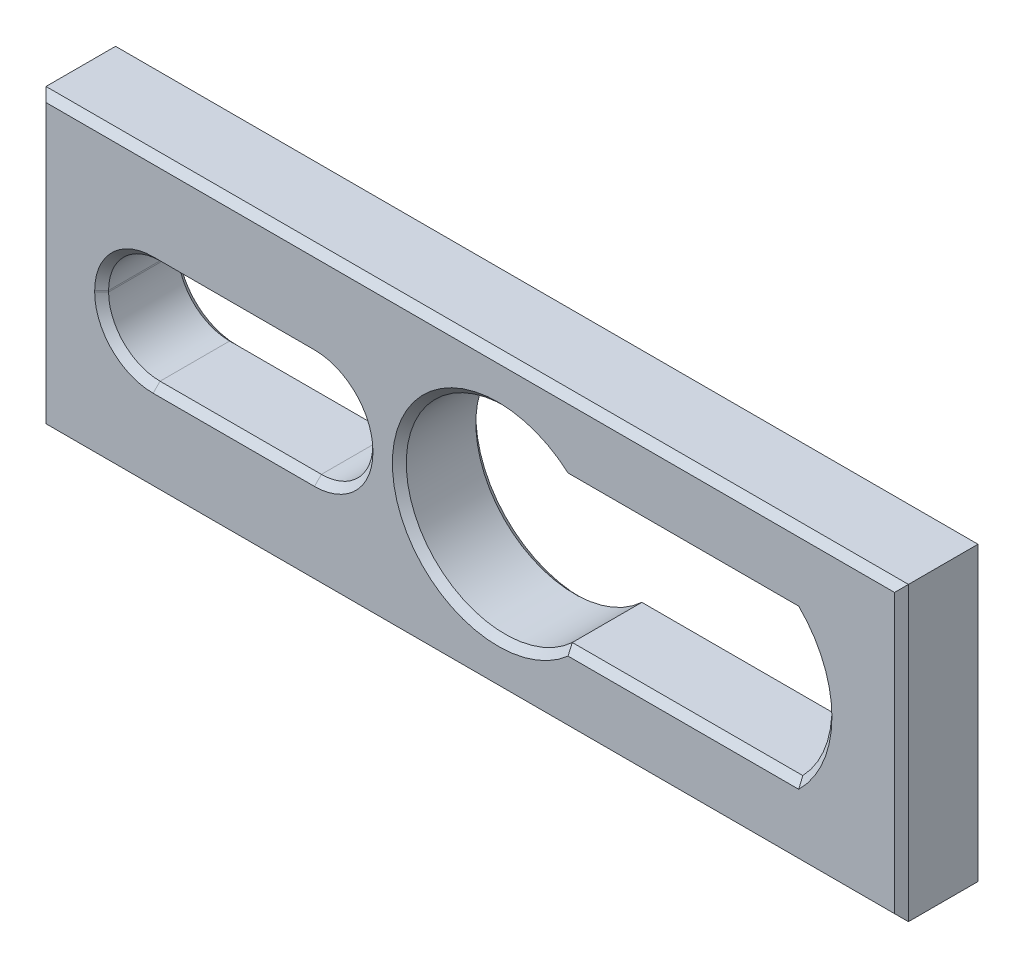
ISO-10303-21;
HEADER;
FILE_DESCRIPTION(('STEP AP214'),'2;1');
FILE_NAME('part.step','',(''),(''),'','','');
FILE_SCHEMA(('AUTOMOTIVE_DESIGN { 1 0 10303 214 1 1 1 1 }'));
ENDSEC;
DATA;
#1=APPLICATION_CONTEXT('core data for automotive mechanical design processes');
#2=APPLICATION_PROTOCOL_DEFINITION('international standard','automotive_design',2000,#1);
#3=PRODUCT_CONTEXT('',#1,'mechanical');
#4=PRODUCT('Part','Part','',(#3));
#5=PRODUCT_RELATED_PRODUCT_CATEGORY('part','',(#4));
#6=PRODUCT_DEFINITION_FORMATION('','',#4);
#7=PRODUCT_DEFINITION_CONTEXT('part definition',#1,'design');
#8=PRODUCT_DEFINITION('design','',#6,#7);
#9=PRODUCT_DEFINITION_SHAPE('','',#8);
#10=(LENGTH_UNIT() NAMED_UNIT(*) SI_UNIT(.MILLI.,.METRE.));
#11=(NAMED_UNIT(*) PLANE_ANGLE_UNIT() SI_UNIT($,.RADIAN.));
#12=(NAMED_UNIT(*) SI_UNIT($,.STERADIAN.) SOLID_ANGLE_UNIT());
#13=UNCERTAINTY_MEASURE_WITH_UNIT(LENGTH_MEASURE(1.E-05),#10,'distance_accuracy_value','');
#14=(GEOMETRIC_REPRESENTATION_CONTEXT(3) GLOBAL_UNCERTAINTY_ASSIGNED_CONTEXT((#13)) GLOBAL_UNIT_ASSIGNED_CONTEXT((#10,
#11,#12)) REPRESENTATION_CONTEXT('',''));
#15=CARTESIAN_POINT('',(0.,0.,0.));
#16=DIRECTION('',(0.,0.,1.));
#17=DIRECTION('',(1.,0.,0.));
#18=AXIS2_PLACEMENT_3D('',#15,#16,#17);
#19=CARTESIAN_POINT('',(31.,10.5,6.));
#20=DIRECTION('',(-1.,0.,0.));
#21=DIRECTION('',(0.,0.,1.));
#22=AXIS2_PLACEMENT_3D('',#19,#20,#21);
#23=PLANE('',#22);
#24=DIRECTION('',(0.,0.,-1.));
#25=VECTOR('',#24,1.);
#26=CARTESIAN_POINT('',(31.,-10.5,6.));
#27=LINE('',#26,#25);
#28=CARTESIAN_POINT('',(31.,-10.5,5.5));
#29=VERTEX_POINT('',#28);
#30=CARTESIAN_POINT('',(31.,-10.5,0.5));
#31=VERTEX_POINT('',#30);
#32=EDGE_CURVE('E557',#29,#31,#27,.T.);
#33=ORIENTED_EDGE('',*,*,#32,.T.);
#34=DIRECTION('',(0.,1.,0.));
#35=VECTOR('',#34,1.);
#36=CARTESIAN_POINT('',(31.,10.5,0.5));
#37=LINE('',#36,#35);
#38=CARTESIAN_POINT('',(31.,10.5,0.5));
#39=VERTEX_POINT('',#38);
#40=EDGE_CURVE('E448',#31,#39,#37,.T.);
#41=ORIENTED_EDGE('',*,*,#40,.T.);
#42=DIRECTION('',(0.,0.,-1.));
#43=VECTOR('',#42,1.);
#44=CARTESIAN_POINT('',(31.,10.5,6.));
#45=LINE('',#44,#43);
#46=CARTESIAN_POINT('',(31.,10.5,5.5));
#47=VERTEX_POINT('',#46);
#48=EDGE_CURVE('E267',#47,#39,#45,.T.);
#49=ORIENTED_EDGE('',*,*,#48,.F.);
#50=DIRECTION('',(0.,-1.,0.));
#51=VECTOR('',#50,1.);
#52=CARTESIAN_POINT('',(31.,-10.5,5.5));
#53=LINE('',#52,#51);
#54=EDGE_CURVE('E446',#47,#29,#53,.T.);
#55=ORIENTED_EDGE('',*,*,#54,.T.);
#56=EDGE_LOOP('',(#33,#41,#49,#55));
#57=FACE_BOUND('',#56,.T.);
#58=ADVANCED_FACE('F32',(#57),#23,.F.);
#59=CARTESIAN_POINT('',(-31.,10.5,6.));
#60=DIRECTION('',(0.,-1.,0.));
#61=DIRECTION('',(0.,0.,-1.));
#62=AXIS2_PLACEMENT_3D('',#59,#60,#61);
#63=PLANE('',#62);
#64=ORIENTED_EDGE('',*,*,#48,.T.);
#65=DIRECTION('',(-1.,0.,0.));
#66=VECTOR('',#65,1.);
#67=CARTESIAN_POINT('',(-31.,10.5,0.5));
#68=LINE('',#67,#66);
#69=CARTESIAN_POINT('',(-31.,10.5,0.5));
#70=VERTEX_POINT('',#69);
#71=EDGE_CURVE('E266',#39,#70,#68,.T.);
#72=ORIENTED_EDGE('',*,*,#71,.T.);
#73=DIRECTION('',(0.,0.,-1.));
#74=VECTOR('',#73,1.);
#75=CARTESIAN_POINT('',(-31.,10.5,6.));
#76=LINE('',#75,#74);
#77=CARTESIAN_POINT('',(-31.,10.5,5.5));
#78=VERTEX_POINT('',#77);
#79=EDGE_CURVE('E249',#78,#70,#76,.T.);
#80=ORIENTED_EDGE('',*,*,#79,.F.);
#81=DIRECTION('',(1.,0.,0.));
#82=VECTOR('',#81,1.);
#83=CARTESIAN_POINT('',(31.,10.5,5.5));
#84=LINE('',#83,#82);
#85=EDGE_CURVE('E263',#78,#47,#84,.T.);
#86=ORIENTED_EDGE('',*,*,#85,.T.);
#87=EDGE_LOOP('',(#64,#72,#80,#86));
#88=FACE_BOUND('',#87,.T.);
#89=ADVANCED_FACE('F262',(#88),#63,.F.);
#90=CARTESIAN_POINT('',(-31.,10.5,6.));
#91=DIRECTION('',(1.,0.,0.));
#92=DIRECTION('',(0.,0.,-1.));
#93=AXIS2_PLACEMENT_3D('',#90,#91,#92);
#94=PLANE('',#93);
#95=ORIENTED_EDGE('',*,*,#79,.T.);
#96=DIRECTION('',(0.,-1.,0.));
#97=VECTOR('',#96,1.);
#98=CARTESIAN_POINT('',(-31.,10.5,0.5));
#99=LINE('',#98,#97);
#100=CARTESIAN_POINT('',(-31.,-10.5,0.5));
#101=VERTEX_POINT('',#100);
#102=EDGE_CURVE('E255',#70,#101,#99,.T.);
#103=ORIENTED_EDGE('',*,*,#102,.T.);
#104=DIRECTION('',(0.,0.,-1.));
#105=VECTOR('',#104,1.);
#106=CARTESIAN_POINT('',(-31.,-10.5,6.));
#107=LINE('',#106,#105);
#108=CARTESIAN_POINT('',(-31.,-10.5,5.5));
#109=VERTEX_POINT('',#108);
#110=EDGE_CURVE('E251',#109,#101,#107,.T.);
#111=ORIENTED_EDGE('',*,*,#110,.F.);
#112=DIRECTION('',(0.,1.,0.));
#113=VECTOR('',#112,1.);
#114=CARTESIAN_POINT('',(-31.,10.5,5.5));
#115=LINE('',#114,#113);
#116=EDGE_CURVE('E246',#109,#78,#115,.T.);
#117=ORIENTED_EDGE('',*,*,#116,.T.);
#118=EDGE_LOOP('',(#95,#103,#111,#117));
#119=FACE_BOUND('',#118,.T.);
#120=ADVANCED_FACE('F248',(#119),#94,.F.);
#121=CARTESIAN_POINT('',(-31.,-10.5,6.));
#122=DIRECTION('',(0.,1.,0.));
#123=DIRECTION('',(-1.,0.,0.));
#124=AXIS2_PLACEMENT_3D('',#121,#122,#123);
#125=PLANE('',#124);
#126=ORIENTED_EDGE('',*,*,#110,.T.);
#127=DIRECTION('',(1.,0.,0.));
#128=VECTOR('',#127,1.);
#129=CARTESIAN_POINT('',(-31.,-10.5,0.5));
#130=LINE('',#129,#128);
#131=EDGE_CURVE('E449',#101,#31,#130,.T.);
#132=ORIENTED_EDGE('',*,*,#131,.T.);
#133=ORIENTED_EDGE('',*,*,#32,.F.);
#134=DIRECTION('',(-1.,0.,0.));
#135=VECTOR('',#134,1.);
#136=CARTESIAN_POINT('',(-31.,-10.5,5.5));
#137=LINE('',#136,#135);
#138=EDGE_CURVE('E435',#29,#109,#137,.T.);
#139=ORIENTED_EDGE('',*,*,#138,.T.);
#140=EDGE_LOOP('',(#126,#132,#133,#139));
#141=FACE_BOUND('',#140,.T.);
#142=ADVANCED_FACE('F622',(#141),#125,.F.);
#143=CARTESIAN_POINT('',(0.,0.,6.));
#144=DIRECTION('',(0.,0.,1.));
#145=DIRECTION('',(1.,0.,0.));
#146=AXIS2_PLACEMENT_3D('',#143,#144,#145);
#147=PLANE('',#146);
#148=DIRECTION('',(0.,-1.,0.));
#149=VECTOR('',#148,1.);
#150=CARTESIAN_POINT('',(-30.5,-10.5,6.));
#151=LINE('',#150,#149);
#152=CARTESIAN_POINT('',(-30.5,10.,6.));
#153=VERTEX_POINT('',#152);
#154=CARTESIAN_POINT('',(-30.5,-10.,6.));
#155=VERTEX_POINT('',#154);
#156=EDGE_CURVE('E45',#153,#155,#151,.T.);
#157=ORIENTED_EDGE('',*,*,#156,.T.);
#158=DIRECTION('',(1.,0.,0.));
#159=VECTOR('',#158,1.);
#160=CARTESIAN_POINT('',(31.,-10.,6.));
#161=LINE('',#160,#159);
#162=CARTESIAN_POINT('',(30.5,-10.,6.));
#163=VERTEX_POINT('',#162);
#164=EDGE_CURVE('E11',#155,#163,#161,.T.);
#165=ORIENTED_EDGE('',*,*,#164,.T.);
#166=DIRECTION('',(0.,1.,0.));
#167=VECTOR('',#166,1.);
#168=CARTESIAN_POINT('',(30.5,10.5,6.));
#169=LINE('',#168,#167);
#170=CARTESIAN_POINT('',(30.5,10.,6.));
#171=VERTEX_POINT('',#170);
#172=EDGE_CURVE('E440',#163,#171,#169,.T.);
#173=ORIENTED_EDGE('',*,*,#172,.T.);
#174=DIRECTION('',(-1.,0.,0.));
#175=VECTOR('',#174,1.);
#176=CARTESIAN_POINT('',(-31.,10.,6.));
#177=LINE('',#176,#175);
#178=EDGE_CURVE('E56',#171,#153,#177,.T.);
#179=ORIENTED_EDGE('',*,*,#178,.T.);
#180=EDGE_LOOP('',(#157,#165,#173,#179));
#181=FACE_BOUND('',#180,.T.);
#182=CARTESIAN_POINT('',(-11.2,-0.0499999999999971,6.));
#183=DIRECTION('',(0.,0.,1.));
#184=DIRECTION('',(1.,0.,0.));
#185=AXIS2_PLACEMENT_3D('',#182,#183,#184);
#186=CIRCLE('',#185,4.20000000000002);
#187=CARTESIAN_POINT('',(-6.99999999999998,-0.0499999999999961,6.));
#188=VERTEX_POINT('',#187);
#189=CARTESIAN_POINT('',(-11.2,-4.25000000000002,6.));
#190=VERTEX_POINT('',#189);
#191=EDGE_CURVE('E528',#188,#190,#186,.F.);
#192=ORIENTED_EDGE('',*,*,#191,.T.);
#193=DIRECTION('',(-1.,0.,0.));
#194=VECTOR('',#193,1.);
#195=CARTESIAN_POINT('',(-22.8,-4.25000000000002,6.));
#196=LINE('',#195,#194);
#197=CARTESIAN_POINT('',(-22.8,-4.25000000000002,6.));
#198=VERTEX_POINT('',#197);
#199=EDGE_CURVE('E442',#190,#198,#196,.T.);
#200=ORIENTED_EDGE('',*,*,#199,.T.);
#201=CARTESIAN_POINT('',(-22.8,-0.0499999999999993,6.));
#202=DIRECTION('',(0.,0.,1.));
#203=DIRECTION('',(1.,0.,0.));
#204=AXIS2_PLACEMENT_3D('',#201,#202,#203);
#205=CIRCLE('',#204,4.20000000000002);
#206=CARTESIAN_POINT('',(-27.,-0.0499999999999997,6.));
#207=VERTEX_POINT('',#206);
#208=EDGE_CURVE('E516',#198,#207,#205,.F.);
#209=ORIENTED_EDGE('',*,*,#208,.T.);
#210=DIRECTION('',(0.,1.,0.));
#211=VECTOR('',#210,1.);
#212=CARTESIAN_POINT('',(-27.,0.0500000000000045,6.));
#213=LINE('',#212,#211);
#214=CARTESIAN_POINT('',(-27.,0.0500000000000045,6.));
#215=VERTEX_POINT('',#214);
#216=EDGE_CURVE('E518',#207,#215,#213,.T.);
#217=ORIENTED_EDGE('',*,*,#216,.T.);
#218=CARTESIAN_POINT('',(-22.8,0.0500000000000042,6.));
#219=DIRECTION('',(0.,0.,1.));
#220=DIRECTION('',(1.,0.,0.));
#221=AXIS2_PLACEMENT_3D('',#218,#219,#220);
#222=CIRCLE('',#221,4.20000000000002);
#223=CARTESIAN_POINT('',(-22.8,4.25000000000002,6.));
#224=VERTEX_POINT('',#223);
#225=EDGE_CURVE('E520',#215,#224,#222,.F.);
#226=ORIENTED_EDGE('',*,*,#225,.T.);
#227=DIRECTION('',(1.,0.,0.));
#228=VECTOR('',#227,1.);
#229=CARTESIAN_POINT('',(-11.2,4.25000000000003,6.));
#230=LINE('',#229,#228);
#231=CARTESIAN_POINT('',(-11.2,4.25000000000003,6.));
#232=VERTEX_POINT('',#231);
#233=EDGE_CURVE('E522',#224,#232,#230,.T.);
#234=ORIENTED_EDGE('',*,*,#233,.T.);
#235=CARTESIAN_POINT('',(-11.2,0.0500000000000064,6.));
#236=DIRECTION('',(0.,0.,1.));
#237=DIRECTION('',(1.,0.,0.));
#238=AXIS2_PLACEMENT_3D('',#235,#236,#237);
#239=CIRCLE('',#238,4.20000000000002);
#240=CARTESIAN_POINT('',(-6.99999999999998,0.0500000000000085,6.));
#241=VERTEX_POINT('',#240);
#242=EDGE_CURVE('E524',#232,#241,#239,.F.);
#243=ORIENTED_EDGE('',*,*,#242,.T.);
#244=DIRECTION('',(0.,-1.,0.));
#245=VECTOR('',#244,1.);
#246=CARTESIAN_POINT('',(-6.99999999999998,-0.0499999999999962,6.));
#247=LINE('',#246,#245);
#248=EDGE_CURVE('E526',#241,#188,#247,.T.);
#249=ORIENTED_EDGE('',*,*,#248,.T.);
#250=EDGE_LOOP('',(#192,#200,#209,#217,#226,#234,#243,#249));
#251=FACE_BOUND('',#250,.T.);
#252=DIRECTION('',(-1.,0.,0.));
#253=VECTOR('',#252,1.);
#254=CARTESIAN_POINT('',(6.83425278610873,-5.69999999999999,6.));
#255=LINE('',#254,#253);
#256=CARTESIAN_POINT('',(23.6133768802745,-5.69999999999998,6.));
#257=VERTEX_POINT('',#256);
#258=CARTESIAN_POINT('',(7.02692749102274,-5.69999999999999,6.));
#259=VERTEX_POINT('',#258);
#260=EDGE_CURVE('E511',#257,#259,#255,.T.);
#261=ORIENTED_EDGE('',*,*,#260,.T.);
#262=CARTESIAN_POINT('',(2.,0.,6.));
#263=DIRECTION('',(0.,0.,1.));
#264=DIRECTION('',(1.,0.,0.));
#265=AXIS2_PLACEMENT_3D('',#262,#263,#264);
#266=CIRCLE('',#265,7.59999999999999);
#267=CARTESIAN_POINT('',(7.02692749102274,5.69999999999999,6.));
#268=VERTEX_POINT('',#267);
#269=EDGE_CURVE('E513',#259,#268,#266,.F.);
#270=ORIENTED_EDGE('',*,*,#269,.T.);
#271=DIRECTION('',(1.,0.,0.));
#272=VECTOR('',#271,1.);
#273=CARTESIAN_POINT('',(23.4046276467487,5.69999999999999,6.));
#274=LINE('',#273,#272);
#275=CARTESIAN_POINT('',(23.6133768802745,5.69999999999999,6.));
#276=VERTEX_POINT('',#275);
#277=EDGE_CURVE('E507',#268,#276,#274,.T.);
#278=ORIENTED_EDGE('',*,*,#277,.T.);
#279=CARTESIAN_POINT('',(18.,0.,6.));
#280=DIRECTION('',(0.,0.,1.));
#281=DIRECTION('',(1.,0.,0.));
#282=AXIS2_PLACEMENT_3D('',#279,#280,#281);
#283=CIRCLE('',#282,7.99999999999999);
#284=EDGE_CURVE('E509',#276,#257,#283,.F.);
#285=ORIENTED_EDGE('',*,*,#284,.T.);
#286=EDGE_LOOP('',(#261,#270,#278,#285));
#287=FACE_BOUND('',#286,.T.);
#288=ADVANCED_FACE('F438',(#181,#251,#287),#147,.T.);
#289=CARTESIAN_POINT('',(0.,0.,0.));
#290=DIRECTION('',(0.,0.,1.));
#291=DIRECTION('',(1.,0.,0.));
#292=AXIS2_PLACEMENT_3D('',#289,#290,#291);
#293=PLANE('',#292);
#294=DIRECTION('',(0.,1.,0.));
#295=VECTOR('',#294,1.);
#296=CARTESIAN_POINT('',(-30.5,0.,0.));
#297=LINE('',#296,#295);
#298=CARTESIAN_POINT('',(-30.5,-10.,0.));
#299=VERTEX_POINT('',#298);
#300=CARTESIAN_POINT('',(-30.5,10.,0.));
#301=VERTEX_POINT('',#300);
#302=EDGE_CURVE('E617',#299,#301,#297,.T.);
#303=ORIENTED_EDGE('',*,*,#302,.T.);
#304=DIRECTION('',(1.,0.,0.));
#305=VECTOR('',#304,1.);
#306=CARTESIAN_POINT('',(0.,10.,0.));
#307=LINE('',#306,#305);
#308=CARTESIAN_POINT('',(30.5,10.,0.));
#309=VERTEX_POINT('',#308);
#310=EDGE_CURVE('E256',#301,#309,#307,.T.);
#311=ORIENTED_EDGE('',*,*,#310,.T.);
#312=DIRECTION('',(0.,-1.,0.));
#313=VECTOR('',#312,1.);
#314=CARTESIAN_POINT('',(30.5,0.,0.));
#315=LINE('',#314,#313);
#316=CARTESIAN_POINT('',(30.5,-10.,0.));
#317=VERTEX_POINT('',#316);
#318=EDGE_CURVE('E613',#309,#317,#315,.T.);
#319=ORIENTED_EDGE('',*,*,#318,.T.);
#320=DIRECTION('',(-1.,0.,0.));
#321=VECTOR('',#320,1.);
#322=CARTESIAN_POINT('',(0.,-10.,0.));
#323=LINE('',#322,#321);
#324=EDGE_CURVE('E615',#317,#299,#323,.T.);
#325=ORIENTED_EDGE('',*,*,#324,.T.);
#326=EDGE_LOOP('',(#303,#311,#319,#325));
#327=FACE_BOUND('',#326,.T.);
#328=CARTESIAN_POINT('',(2.,0.,0.));
#329=DIRECTION('',(0.,0.,1.));
#330=DIRECTION('',(1.,0.,0.));
#331=AXIS2_PLACEMENT_3D('',#328,#329,#330);
#332=CIRCLE('',#331,7.6);
#333=CARTESIAN_POINT('',(7.02692749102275,5.69999999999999,0.));
#334=VERTEX_POINT('',#333);
#335=CARTESIAN_POINT('',(7.02692749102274,-5.69999999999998,0.));
#336=VERTEX_POINT('',#335);
#337=EDGE_CURVE('E608',#334,#336,#332,.T.);
#338=ORIENTED_EDGE('',*,*,#337,.T.);
#339=DIRECTION('',(1.,0.,0.));
#340=VECTOR('',#339,1.);
#341=CARTESIAN_POINT('',(0.,-5.7,0.));
#342=LINE('',#341,#340);
#343=CARTESIAN_POINT('',(23.6133768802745,-5.69999999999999,0.));
#344=VERTEX_POINT('',#343);
#345=EDGE_CURVE('E610',#336,#344,#342,.T.);
#346=ORIENTED_EDGE('',*,*,#345,.T.);
#347=CARTESIAN_POINT('',(18.,0.,0.));
#348=DIRECTION('',(0.,0.,1.));
#349=DIRECTION('',(1.,0.,0.));
#350=AXIS2_PLACEMENT_3D('',#347,#348,#349);
#351=CIRCLE('',#350,8.);
#352=CARTESIAN_POINT('',(23.6133768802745,5.69999999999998,0.));
#353=VERTEX_POINT('',#352);
#354=EDGE_CURVE('E604',#344,#353,#351,.T.);
#355=ORIENTED_EDGE('',*,*,#354,.T.);
#356=DIRECTION('',(-1.,0.,0.));
#357=VECTOR('',#356,1.);
#358=CARTESIAN_POINT('',(0.,5.69999999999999,0.));
#359=LINE('',#358,#357);
#360=EDGE_CURVE('E606',#353,#334,#359,.T.);
#361=ORIENTED_EDGE('',*,*,#360,.T.);
#362=EDGE_LOOP('',(#338,#346,#355,#361));
#363=FACE_BOUND('',#362,.T.);
#364=DIRECTION('',(-1.,0.,0.));
#365=VECTOR('',#364,1.);
#366=CARTESIAN_POINT('',(0.,4.25,0.));
#367=LINE('',#366,#365);
#368=CARTESIAN_POINT('',(-11.2,4.25,0.));
#369=VERTEX_POINT('',#368);
#370=CARTESIAN_POINT('',(-22.8,4.25,0.));
#371=VERTEX_POINT('',#370);
#372=EDGE_CURVE('E599',#369,#371,#367,.T.);
#373=ORIENTED_EDGE('',*,*,#372,.T.);
#374=CARTESIAN_POINT('',(-22.8,0.0500000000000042,0.));
#375=DIRECTION('',(0.,0.,1.));
#376=DIRECTION('',(1.,0.,0.));
#377=AXIS2_PLACEMENT_3D('',#374,#375,#376);
#378=CIRCLE('',#377,4.19999999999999);
#379=CARTESIAN_POINT('',(-27.,0.0500000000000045,0.));
#380=VERTEX_POINT('',#379);
#381=EDGE_CURVE('E601',#371,#380,#378,.T.);
#382=ORIENTED_EDGE('',*,*,#381,.T.);
#383=DIRECTION('',(0.,-1.,0.));
#384=VECTOR('',#383,1.);
#385=CARTESIAN_POINT('',(-27.,0.,0.));
#386=LINE('',#385,#384);
#387=CARTESIAN_POINT('',(-27.,-0.0499999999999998,0.));
#388=VERTEX_POINT('',#387);
#389=EDGE_CURVE('E587',#380,#388,#386,.T.);
#390=ORIENTED_EDGE('',*,*,#389,.T.);
#391=CARTESIAN_POINT('',(-22.8,-0.0499999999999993,0.));
#392=DIRECTION('',(0.,0.,1.));
#393=DIRECTION('',(1.,0.,0.));
#394=AXIS2_PLACEMENT_3D('',#391,#392,#393);
#395=CIRCLE('',#394,4.19999999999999);
#396=CARTESIAN_POINT('',(-22.8,-4.24999999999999,0.));
#397=VERTEX_POINT('',#396);
#398=EDGE_CURVE('E589',#388,#397,#395,.T.);
#399=ORIENTED_EDGE('',*,*,#398,.T.);
#400=DIRECTION('',(1.,0.,0.));
#401=VECTOR('',#400,1.);
#402=CARTESIAN_POINT('',(0.,-4.24999999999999,0.));
#403=LINE('',#402,#401);
#404=CARTESIAN_POINT('',(-11.2,-4.24999999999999,0.));
#405=VERTEX_POINT('',#404);
#406=EDGE_CURVE('E591',#397,#405,#403,.T.);
#407=ORIENTED_EDGE('',*,*,#406,.T.);
#408=CARTESIAN_POINT('',(-11.2,-0.0499999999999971,0.));
#409=DIRECTION('',(0.,0.,1.));
#410=DIRECTION('',(1.,0.,0.));
#411=AXIS2_PLACEMENT_3D('',#408,#409,#410);
#412=CIRCLE('',#411,4.19999999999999);
#413=CARTESIAN_POINT('',(-7.00000000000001,-0.0499999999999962,0.));
#414=VERTEX_POINT('',#413);
#415=EDGE_CURVE('E593',#405,#414,#412,.T.);
#416=ORIENTED_EDGE('',*,*,#415,.T.);
#417=DIRECTION('',(0.,1.,0.));
#418=VECTOR('',#417,1.);
#419=CARTESIAN_POINT('',(-7.00000000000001,0.,0.));
#420=LINE('',#419,#418);
#421=CARTESIAN_POINT('',(-7.00000000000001,0.0500000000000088,0.));
#422=VERTEX_POINT('',#421);
#423=EDGE_CURVE('E595',#414,#422,#420,.T.);
#424=ORIENTED_EDGE('',*,*,#423,.T.);
#425=CARTESIAN_POINT('',(-11.2,0.0500000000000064,0.));
#426=DIRECTION('',(0.,0.,1.));
#427=DIRECTION('',(1.,0.,0.));
#428=AXIS2_PLACEMENT_3D('',#425,#426,#427);
#429=CIRCLE('',#428,4.19999999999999);
#430=EDGE_CURVE('E597',#422,#369,#429,.T.);
#431=ORIENTED_EDGE('',*,*,#430,.T.);
#432=EDGE_LOOP('',(#373,#382,#390,#399,#407,#416,#424,#431));
#433=FACE_BOUND('',#432,.T.);
#434=ADVANCED_FACE('F632',(#327,#363,#433),#293,.F.);
#435=CARTESIAN_POINT('',(2.,0.,0.));
#436=DIRECTION('',(0.,0.,1.));
#437=DIRECTION('',(1.,0.,0.));
#438=AXIS2_PLACEMENT_3D('',#435,#436,#437);
#439=CYLINDRICAL_SURFACE('',#438,7.1);
#440=DIRECTION('',(0.,0.,1.));
#441=VECTOR('',#440,1.);
#442=CARTESIAN_POINT('',(6.83425278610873,-5.2,0.));
#443=LINE('',#442,#441);
#444=CARTESIAN_POINT('',(6.83425278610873,-5.2,5.50000000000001));
#445=VERTEX_POINT('',#444);
#446=CARTESIAN_POINT('',(6.83425278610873,-5.2,0.500000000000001));
#447=VERTEX_POINT('',#446);
#448=EDGE_CURVE('E581',#445,#447,#443,.F.);
#449=ORIENTED_EDGE('',*,*,#448,.T.);
#450=CARTESIAN_POINT('',(2.,0.,0.500000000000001));
#451=DIRECTION('',(0.,0.,1.));
#452=DIRECTION('',(1.,0.,0.));
#453=AXIS2_PLACEMENT_3D('',#450,#451,#452);
#454=CIRCLE('',#453,7.1);
#455=CARTESIAN_POINT('',(6.83425278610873,5.2,0.500000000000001));
#456=VERTEX_POINT('',#455);
#457=EDGE_CURVE('E463',#447,#456,#454,.F.);
#458=ORIENTED_EDGE('',*,*,#457,.T.);
#459=DIRECTION('',(0.,0.,1.));
#460=VECTOR('',#459,1.);
#461=CARTESIAN_POINT('',(6.83425278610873,5.2,0.));
#462=LINE('',#461,#460);
#463=CARTESIAN_POINT('',(6.83425278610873,5.2,5.50000000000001));
#464=VERTEX_POINT('',#463);
#465=EDGE_CURVE('E276',#456,#464,#462,.T.);
#466=ORIENTED_EDGE('',*,*,#465,.T.);
#467=CARTESIAN_POINT('',(2.,0.,5.50000000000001));
#468=DIRECTION('',(0.,0.,1.));
#469=DIRECTION('',(1.,0.,0.));
#470=AXIS2_PLACEMENT_3D('',#467,#468,#469);
#471=CIRCLE('',#470,7.1);
#472=EDGE_CURVE('E460',#464,#445,#471,.T.);
#473=ORIENTED_EDGE('',*,*,#472,.T.);
#474=EDGE_LOOP('',(#449,#458,#466,#473));
#475=FACE_BOUND('',#474,.T.);
#476=ADVANCED_FACE('F635',(#475),#439,.F.);
#477=CARTESIAN_POINT('',(-22.8,-0.0499999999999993,0.));
#478=DIRECTION('',(0.,0.,1.));
#479=DIRECTION('',(1.,0.,0.));
#480=AXIS2_PLACEMENT_3D('',#477,#478,#479);
#481=CYLINDRICAL_SURFACE('',#480,3.7);
#482=DIRECTION('',(0.,0.,1.));
#483=VECTOR('',#482,1.);
#484=CARTESIAN_POINT('',(-22.8,-3.75,0.));
#485=LINE('',#484,#483);
#486=CARTESIAN_POINT('',(-22.8,-3.75,0.5));
#487=VERTEX_POINT('',#486);
#488=CARTESIAN_POINT('',(-22.8,-3.75,5.49999999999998));
#489=VERTEX_POINT('',#488);
#490=EDGE_CURVE('E551',#487,#489,#485,.T.);
#491=ORIENTED_EDGE('',*,*,#490,.F.);
#492=CARTESIAN_POINT('',(-22.8,-0.0499999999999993,0.5));
#493=DIRECTION('',(0.,0.,1.));
#494=DIRECTION('',(1.,0.,0.));
#495=AXIS2_PLACEMENT_3D('',#492,#493,#494);
#496=CIRCLE('',#495,3.7);
#497=CARTESIAN_POINT('',(-26.5,-0.0499999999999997,0.5));
#498=VERTEX_POINT('',#497);
#499=EDGE_CURVE('E501',#487,#498,#496,.F.);
#500=ORIENTED_EDGE('',*,*,#499,.T.);
#501=DIRECTION('',(0.,0.,1.));
#502=VECTOR('',#501,1.);
#503=CARTESIAN_POINT('',(-26.5,-0.0499999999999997,0.));
#504=LINE('',#503,#502);
#505=CARTESIAN_POINT('',(-26.5,-0.0499999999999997,5.49999999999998));
#506=VERTEX_POINT('',#505);
#507=EDGE_CURVE('E554',#498,#506,#504,.T.);
#508=ORIENTED_EDGE('',*,*,#507,.T.);
#509=CARTESIAN_POINT('',(-22.8,-0.0499999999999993,5.49999999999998));
#510=DIRECTION('',(0.,0.,1.));
#511=DIRECTION('',(1.,0.,0.));
#512=AXIS2_PLACEMENT_3D('',#509,#510,#511);
#513=CIRCLE('',#512,3.7);
#514=EDGE_CURVE('E499',#506,#489,#513,.T.);
#515=ORIENTED_EDGE('',*,*,#514,.T.);
#516=EDGE_LOOP('',(#491,#500,#508,#515));
#517=FACE_BOUND('',#516,.T.);
#518=ADVANCED_FACE('F737',(#517),#481,.F.);
#519=CARTESIAN_POINT('',(-26.5,0.0500000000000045,0.));
#520=DIRECTION('',(-1.,0.,0.));
#521=DIRECTION('',(0.,0.,1.));
#522=AXIS2_PLACEMENT_3D('',#519,#520,#521);
#523=PLANE('',#522);
#524=ORIENTED_EDGE('',*,*,#507,.F.);
#525=DIRECTION('',(0.,1.,0.));
#526=VECTOR('',#525,1.);
#527=CARTESIAN_POINT('',(-26.5,0.0500000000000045,0.5));
#528=LINE('',#527,#526);
#529=CARTESIAN_POINT('',(-26.5,0.0500000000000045,0.5));
#530=VERTEX_POINT('',#529);
#531=EDGE_CURVE('E505',#498,#530,#528,.T.);
#532=ORIENTED_EDGE('',*,*,#531,.T.);
#533=DIRECTION('',(0.,0.,1.));
#534=VECTOR('',#533,1.);
#535=CARTESIAN_POINT('',(-26.5,0.0500000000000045,0.));
#536=LINE('',#535,#534);
#537=CARTESIAN_POINT('',(-26.5,0.0500000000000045,5.49999999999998));
#538=VERTEX_POINT('',#537);
#539=EDGE_CURVE('E558',#530,#538,#536,.T.);
#540=ORIENTED_EDGE('',*,*,#539,.T.);
#541=DIRECTION('',(0.,-1.,0.));
#542=VECTOR('',#541,1.);
#543=CARTESIAN_POINT('',(-26.5,-0.0499999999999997,5.49999999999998));
#544=LINE('',#543,#542);
#545=EDGE_CURVE('E503',#538,#506,#544,.T.);
#546=ORIENTED_EDGE('',*,*,#545,.T.);
#547=EDGE_LOOP('',(#524,#532,#540,#546));
#548=FACE_BOUND('',#547,.T.);
#549=ADVANCED_FACE('F734',(#548),#523,.F.);
#550=CARTESIAN_POINT('',(-22.8,0.0500000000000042,0.));
#551=DIRECTION('',(0.,0.,1.));
#552=DIRECTION('',(1.,0.,0.));
#553=AXIS2_PLACEMENT_3D('',#550,#551,#552);
#554=CYLINDRICAL_SURFACE('',#553,3.7);
#555=ORIENTED_EDGE('',*,*,#539,.F.);
#556=CARTESIAN_POINT('',(-22.8,0.0500000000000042,0.5));
#557=DIRECTION('',(0.,0.,1.));
#558=DIRECTION('',(1.,0.,0.));
#559=AXIS2_PLACEMENT_3D('',#556,#557,#558);
#560=CIRCLE('',#559,3.7);
#561=CARTESIAN_POINT('',(-22.8,3.75,0.5));
#562=VERTEX_POINT('',#561);
#563=EDGE_CURVE('E475',#530,#562,#560,.F.);
#564=ORIENTED_EDGE('',*,*,#563,.T.);
#565=DIRECTION('',(0.,0.,1.));
#566=VECTOR('',#565,1.);
#567=CARTESIAN_POINT('',(-22.8,3.75,0.));
#568=LINE('',#567,#566);
#569=CARTESIAN_POINT('',(-22.8,3.75,5.49999999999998));
#570=VERTEX_POINT('',#569);
#571=EDGE_CURVE('E561',#562,#570,#568,.T.);
#572=ORIENTED_EDGE('',*,*,#571,.T.);
#573=CARTESIAN_POINT('',(-22.8,0.0500000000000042,5.49999999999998));
#574=DIRECTION('',(0.,0.,1.));
#575=DIRECTION('',(1.,0.,0.));
#576=AXIS2_PLACEMENT_3D('',#573,#574,#575);
#577=CIRCLE('',#576,3.7);
#578=EDGE_CURVE('E473',#570,#538,#577,.T.);
#579=ORIENTED_EDGE('',*,*,#578,.T.);
#580=EDGE_LOOP('',(#555,#564,#572,#579));
#581=FACE_BOUND('',#580,.T.);
#582=ADVANCED_FACE('F731',(#581),#554,.F.);
#583=CARTESIAN_POINT('',(-22.8,3.75,0.));
#584=DIRECTION('',(0.,1.,0.));
#585=DIRECTION('',(-1.,0.,0.));
#586=AXIS2_PLACEMENT_3D('',#583,#584,#585);
#587=PLANE('',#586);
#588=ORIENTED_EDGE('',*,*,#571,.F.);
#589=DIRECTION('',(1.,0.,0.));
#590=VECTOR('',#589,1.);
#591=CARTESIAN_POINT('',(-22.8,3.75,0.5));
#592=LINE('',#591,#590);
#593=CARTESIAN_POINT('',(-11.2,3.75,0.5));
#594=VERTEX_POINT('',#593);
#595=EDGE_CURVE('E480',#562,#594,#592,.T.);
#596=ORIENTED_EDGE('',*,*,#595,.T.);
#597=DIRECTION('',(0.,0.,1.));
#598=VECTOR('',#597,1.);
#599=CARTESIAN_POINT('',(-11.2,3.75,0.));
#600=LINE('',#599,#598);
#601=CARTESIAN_POINT('',(-11.2,3.75,5.49999999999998));
#602=VERTEX_POINT('',#601);
#603=EDGE_CURVE('E564',#594,#602,#600,.T.);
#604=ORIENTED_EDGE('',*,*,#603,.T.);
#605=DIRECTION('',(-1.,0.,0.));
#606=VECTOR('',#605,1.);
#607=CARTESIAN_POINT('',(-22.8,3.75,5.49999999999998));
#608=LINE('',#607,#606);
#609=EDGE_CURVE('E478',#602,#570,#608,.T.);
#610=ORIENTED_EDGE('',*,*,#609,.T.);
#611=EDGE_LOOP('',(#588,#596,#604,#610));
#612=FACE_BOUND('',#611,.T.);
#613=ADVANCED_FACE('F728',(#612),#587,.F.);
#614=CARTESIAN_POINT('',(-11.2,0.0500000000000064,0.));
#615=DIRECTION('',(0.,0.,1.));
#616=DIRECTION('',(1.,0.,0.));
#617=AXIS2_PLACEMENT_3D('',#614,#615,#616);
#618=CYLINDRICAL_SURFACE('',#617,3.7);
#619=ORIENTED_EDGE('',*,*,#603,.F.);
#620=CARTESIAN_POINT('',(-11.2,0.0500000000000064,0.5));
#621=DIRECTION('',(0.,0.,1.));
#622=DIRECTION('',(1.,0.,0.));
#623=AXIS2_PLACEMENT_3D('',#620,#621,#622);
#624=CIRCLE('',#623,3.7);
#625=CARTESIAN_POINT('',(-7.5,0.0500000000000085,0.5));
#626=VERTEX_POINT('',#625);
#627=EDGE_CURVE('E484',#594,#626,#624,.F.);
#628=ORIENTED_EDGE('',*,*,#627,.T.);
#629=DIRECTION('',(0.,0.,1.));
#630=VECTOR('',#629,1.);
#631=CARTESIAN_POINT('',(-7.5,0.0500000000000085,0.));
#632=LINE('',#631,#630);
#633=CARTESIAN_POINT('',(-7.5,0.0500000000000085,5.49999999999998));
#634=VERTEX_POINT('',#633);
#635=EDGE_CURVE('E567',#626,#634,#632,.T.);
#636=ORIENTED_EDGE('',*,*,#635,.T.);
#637=CARTESIAN_POINT('',(-11.2,0.0500000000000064,5.49999999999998));
#638=DIRECTION('',(0.,0.,1.));
#639=DIRECTION('',(1.,0.,0.));
#640=AXIS2_PLACEMENT_3D('',#637,#638,#639);
#641=CIRCLE('',#640,3.7);
#642=EDGE_CURVE('E482',#634,#602,#641,.T.);
#643=ORIENTED_EDGE('',*,*,#642,.T.);
#644=EDGE_LOOP('',(#619,#628,#636,#643));
#645=FACE_BOUND('',#644,.T.);
#646=ADVANCED_FACE('F682',(#645),#618,.F.);
#647=CARTESIAN_POINT('',(-7.5,0.0500000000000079,0.));
#648=DIRECTION('',(1.,0.,0.));
#649=DIRECTION('',(0.,0.,-1.));
#650=AXIS2_PLACEMENT_3D('',#647,#648,#649);
#651=PLANE('',#650);
#652=ORIENTED_EDGE('',*,*,#635,.F.);
#653=DIRECTION('',(0.,-1.,0.));
#654=VECTOR('',#653,1.);
#655=CARTESIAN_POINT('',(-7.5,0.0500000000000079,0.5));
#656=LINE('',#655,#654);
#657=CARTESIAN_POINT('',(-7.5,-0.0499999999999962,0.5));
#658=VERTEX_POINT('',#657);
#659=EDGE_CURVE('E488',#626,#658,#656,.T.);
#660=ORIENTED_EDGE('',*,*,#659,.T.);
#661=DIRECTION('',(0.,0.,1.));
#662=VECTOR('',#661,1.);
#663=CARTESIAN_POINT('',(-7.5,-0.0499999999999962,0.));
#664=LINE('',#663,#662);
#665=CARTESIAN_POINT('',(-7.5,-0.0499999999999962,5.49999999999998));
#666=VERTEX_POINT('',#665);
#667=EDGE_CURVE('E570',#658,#666,#664,.T.);
#668=ORIENTED_EDGE('',*,*,#667,.T.);
#669=DIRECTION('',(0.,1.,0.));
#670=VECTOR('',#669,1.);
#671=CARTESIAN_POINT('',(-7.5,0.0500000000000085,5.49999999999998));
#672=LINE('',#671,#670);
#673=EDGE_CURVE('E486',#666,#634,#672,.T.);
#674=ORIENTED_EDGE('',*,*,#673,.T.);
#675=EDGE_LOOP('',(#652,#660,#668,#674));
#676=FACE_BOUND('',#675,.T.);
#677=ADVANCED_FACE('F685',(#676),#651,.F.);
#678=CARTESIAN_POINT('',(-11.2,-0.0499999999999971,0.));
#679=DIRECTION('',(0.,0.,1.));
#680=DIRECTION('',(1.,0.,0.));
#681=AXIS2_PLACEMENT_3D('',#678,#679,#680);
#682=CYLINDRICAL_SURFACE('',#681,3.7);
#683=ORIENTED_EDGE('',*,*,#667,.F.);
#684=CARTESIAN_POINT('',(-11.2,-0.0499999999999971,0.5));
#685=DIRECTION('',(0.,0.,1.));
#686=DIRECTION('',(1.,0.,0.));
#687=AXIS2_PLACEMENT_3D('',#684,#685,#686);
#688=CIRCLE('',#687,3.7);
#689=CARTESIAN_POINT('',(-11.2,-3.74999999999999,0.5));
#690=VERTEX_POINT('',#689);
#691=EDGE_CURVE('E492',#658,#690,#688,.F.);
#692=ORIENTED_EDGE('',*,*,#691,.T.);
#693=DIRECTION('',(0.,0.,1.));
#694=VECTOR('',#693,1.);
#695=CARTESIAN_POINT('',(-11.2,-3.74999999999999,0.));
#696=LINE('',#695,#694);
#697=CARTESIAN_POINT('',(-11.2,-3.74999999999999,5.49999999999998));
#698=VERTEX_POINT('',#697);
#699=EDGE_CURVE('E573',#690,#698,#696,.T.);
#700=ORIENTED_EDGE('',*,*,#699,.T.);
#701=CARTESIAN_POINT('',(-11.2,-0.0499999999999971,5.49999999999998));
#702=DIRECTION('',(0.,0.,1.));
#703=DIRECTION('',(1.,0.,0.));
#704=AXIS2_PLACEMENT_3D('',#701,#702,#703);
#705=CIRCLE('',#704,3.7);
#706=EDGE_CURVE('E490',#698,#666,#705,.T.);
#707=ORIENTED_EDGE('',*,*,#706,.T.);
#708=EDGE_LOOP('',(#683,#692,#700,#707));
#709=FACE_BOUND('',#708,.T.);
#710=ADVANCED_FACE('F742',(#709),#682,.F.);
#711=CARTESIAN_POINT('',(-22.8,-3.75,0.));
#712=DIRECTION('',(0.,-1.,0.));
#713=DIRECTION('',(1.,0.,0.));
#714=AXIS2_PLACEMENT_3D('',#711,#712,#713);
#715=PLANE('',#714);
#716=ORIENTED_EDGE('',*,*,#699,.F.);
#717=DIRECTION('',(-1.,0.,0.));
#718=VECTOR('',#717,1.);
#719=CARTESIAN_POINT('',(-22.8,-3.75,0.5));
#720=LINE('',#719,#718);
#721=EDGE_CURVE('E497',#690,#487,#720,.T.);
#722=ORIENTED_EDGE('',*,*,#721,.T.);
#723=ORIENTED_EDGE('',*,*,#490,.T.);
#724=DIRECTION('',(1.,0.,0.));
#725=VECTOR('',#724,1.);
#726=CARTESIAN_POINT('',(-11.2,-3.75,5.49999999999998));
#727=LINE('',#726,#725);
#728=EDGE_CURVE('E494',#489,#698,#727,.T.);
#729=ORIENTED_EDGE('',*,*,#728,.T.);
#730=EDGE_LOOP('',(#716,#722,#723,#729));
#731=FACE_BOUND('',#730,.T.);
#732=ADVANCED_FACE('F740',(#731),#715,.F.);
#733=CARTESIAN_POINT('',(23.4046276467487,5.2,0.));
#734=DIRECTION('',(0.,1.,0.));
#735=DIRECTION('',(-1.,0.,0.));
#736=AXIS2_PLACEMENT_3D('',#733,#734,#735);
#737=PLANE('',#736);
#738=ORIENTED_EDGE('',*,*,#465,.F.);
#739=DIRECTION('',(1.,0.,0.));
#740=VECTOR('',#739,1.);
#741=CARTESIAN_POINT('',(23.4046276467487,5.2,0.500000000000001));
#742=LINE('',#741,#740);
#743=CARTESIAN_POINT('',(23.4046276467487,5.2,0.500000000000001));
#744=VERTEX_POINT('',#743);
#745=EDGE_CURVE('E467',#456,#744,#742,.T.);
#746=ORIENTED_EDGE('',*,*,#745,.T.);
#747=DIRECTION('',(0.,0.,1.));
#748=VECTOR('',#747,1.);
#749=CARTESIAN_POINT('',(23.4046276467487,5.2,0.));
#750=LINE('',#749,#748);
#751=CARTESIAN_POINT('',(23.4046276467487,5.2,5.50000000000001));
#752=VERTEX_POINT('',#751);
#753=EDGE_CURVE('E545',#744,#752,#750,.T.);
#754=ORIENTED_EDGE('',*,*,#753,.T.);
#755=DIRECTION('',(-1.,0.,0.));
#756=VECTOR('',#755,1.);
#757=CARTESIAN_POINT('',(6.83425278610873,5.2,5.50000000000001));
#758=LINE('',#757,#756);
#759=EDGE_CURVE('E465',#752,#464,#758,.T.);
#760=ORIENTED_EDGE('',*,*,#759,.T.);
#761=EDGE_LOOP('',(#738,#746,#754,#760));
#762=FACE_BOUND('',#761,.T.);
#763=ADVANCED_FACE('F749',(#762),#737,.F.);
#764=CARTESIAN_POINT('',(4.49999999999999,-5.2,0.));
#765=DIRECTION('',(0.,-1.,0.));
#766=DIRECTION('',(1.,0.,0.));
#767=AXIS2_PLACEMENT_3D('',#764,#765,#766);
#768=PLANE('',#767);
#769=DIRECTION('',(0.,0.,1.));
#770=VECTOR('',#769,1.);
#771=CARTESIAN_POINT('',(23.4046276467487,-5.2,0.));
#772=LINE('',#771,#770);
#773=CARTESIAN_POINT('',(23.4046276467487,-5.2,0.500000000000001));
#774=VERTEX_POINT('',#773);
#775=CARTESIAN_POINT('',(23.4046276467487,-5.2,5.50000000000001));
#776=VERTEX_POINT('',#775);
#777=EDGE_CURVE('E540',#774,#776,#772,.T.);
#778=ORIENTED_EDGE('',*,*,#777,.F.);
#779=DIRECTION('',(-1.,0.,0.));
#780=VECTOR('',#779,1.);
#781=CARTESIAN_POINT('',(4.49999999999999,-5.2,0.500000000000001));
#782=LINE('',#781,#780);
#783=EDGE_CURVE('E457',#774,#447,#782,.T.);
#784=ORIENTED_EDGE('',*,*,#783,.T.);
#785=ORIENTED_EDGE('',*,*,#448,.F.);
#786=DIRECTION('',(1.,0.,0.));
#787=VECTOR('',#786,1.);
#788=CARTESIAN_POINT('',(23.4046276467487,-5.2,5.50000000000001));
#789=LINE('',#788,#787);
#790=EDGE_CURVE('E451',#445,#776,#789,.T.);
#791=ORIENTED_EDGE('',*,*,#790,.T.);
#792=EDGE_LOOP('',(#778,#784,#785,#791));
#793=FACE_BOUND('',#792,.T.);
#794=ADVANCED_FACE('F833',(#793),#768,.F.);
#795=CARTESIAN_POINT('',(18.,0.,0.));
#796=DIRECTION('',(0.,0.,1.));
#797=DIRECTION('',(1.,0.,0.));
#798=AXIS2_PLACEMENT_3D('',#795,#796,#797);
#799=CYLINDRICAL_SURFACE('',#798,7.5);
#800=ORIENTED_EDGE('',*,*,#753,.F.);
#801=CARTESIAN_POINT('',(18.,0.,0.500000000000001));
#802=DIRECTION('',(0.,0.,1.));
#803=DIRECTION('',(1.,0.,0.));
#804=AXIS2_PLACEMENT_3D('',#801,#802,#803);
#805=CIRCLE('',#804,7.5);
#806=EDGE_CURVE('E471',#744,#774,#805,.F.);
#807=ORIENTED_EDGE('',*,*,#806,.T.);
#808=ORIENTED_EDGE('',*,*,#777,.T.);
#809=CARTESIAN_POINT('',(18.,0.,5.50000000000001));
#810=DIRECTION('',(0.,0.,1.));
#811=DIRECTION('',(1.,0.,0.));
#812=AXIS2_PLACEMENT_3D('',#809,#810,#811);
#813=CIRCLE('',#812,7.5);
#814=EDGE_CURVE('E469',#776,#752,#813,.T.);
#815=ORIENTED_EDGE('',*,*,#814,.T.);
#816=EDGE_LOOP('',(#800,#807,#808,#815));
#817=FACE_BOUND('',#816,.T.);
#818=ADVANCED_FACE('F368',(#817),#799,.F.);
#819=CARTESIAN_POINT('',(-31.,-10.5,0.5));
#820=DIRECTION('',(0.,0.707106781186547,0.707106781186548));
#821=DIRECTION('',(1.,0.,0.));
#822=AXIS2_PLACEMENT_3D('',#819,#820,#821);
#823=PLANE('',#822);
#824=DIRECTION('',(0.577350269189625,0.577350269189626,-0.577350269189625));
#825=VECTOR('',#824,1.);
#826=CARTESIAN_POINT('',(-31.,-10.5,0.5));
#827=LINE('',#826,#825);
#828=EDGE_CURVE('E536',#299,#101,#827,.F.);
#829=ORIENTED_EDGE('',*,*,#828,.F.);
#830=ORIENTED_EDGE('',*,*,#324,.F.);
#831=DIRECTION('',(-0.577350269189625,0.577350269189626,-0.577350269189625));
#832=VECTOR('',#831,1.);
#833=CARTESIAN_POINT('',(24.,-3.49999999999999,-6.5));
#834=LINE('',#833,#832);
#835=EDGE_CURVE('E538',#31,#317,#834,.T.);
#836=ORIENTED_EDGE('',*,*,#835,.F.);
#837=ORIENTED_EDGE('',*,*,#131,.F.);
#838=EDGE_LOOP('',(#829,#830,#836,#837));
#839=FACE_BOUND('',#838,.T.);
#840=ADVANCED_FACE('F364',(#839),#823,.F.);
#841=CARTESIAN_POINT('',(31.,10.5,0.5));
#842=DIRECTION('',(-0.707106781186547,0.,0.707106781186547));
#843=DIRECTION('',(0.,1.,0.));
#844=AXIS2_PLACEMENT_3D('',#841,#842,#843);
#845=PLANE('',#844);
#846=ORIENTED_EDGE('',*,*,#835,.T.);
#847=ORIENTED_EDGE('',*,*,#318,.F.);
#848=DIRECTION('',(0.577350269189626,0.577350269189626,0.577350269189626));
#849=VECTOR('',#848,1.);
#850=CARTESIAN_POINT('',(31.,10.5,0.5));
#851=LINE('',#850,#849);
#852=EDGE_CURVE('E534',#39,#309,#851,.F.);
#853=ORIENTED_EDGE('',*,*,#852,.F.);
#854=ORIENTED_EDGE('',*,*,#40,.F.);
#855=EDGE_LOOP('',(#846,#847,#853,#854));
#856=FACE_BOUND('',#855,.T.);
#857=ADVANCED_FACE('F360',(#856),#845,.F.);
#858=CARTESIAN_POINT('',(-31.,10.5,0.5));
#859=DIRECTION('',(0.707106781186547,0.,0.707106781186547));
#860=DIRECTION('',(0.,-1.,0.));
#861=AXIS2_PLACEMENT_3D('',#858,#859,#860);
#862=PLANE('',#861);
#863=ORIENTED_EDGE('',*,*,#828,.T.);
#864=ORIENTED_EDGE('',*,*,#102,.F.);
#865=DIRECTION('',(0.577350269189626,-0.577350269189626,-0.577350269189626));
#866=VECTOR('',#865,1.);
#867=CARTESIAN_POINT('',(-31.,10.5,0.5));
#868=LINE('',#867,#866);
#869=EDGE_CURVE('E410',#301,#70,#868,.F.);
#870=ORIENTED_EDGE('',*,*,#869,.F.);
#871=ORIENTED_EDGE('',*,*,#302,.F.);
#872=EDGE_LOOP('',(#863,#864,#870,#871));
#873=FACE_BOUND('',#872,.T.);
#874=ADVANCED_FACE('F356',(#873),#862,.F.);
#875=CARTESIAN_POINT('',(-31.,10.5,0.5));
#876=DIRECTION('',(0.,-0.707106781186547,0.707106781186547));
#877=DIRECTION('',(-1.,0.,0.));
#878=AXIS2_PLACEMENT_3D('',#875,#876,#877);
#879=PLANE('',#878);
#880=ORIENTED_EDGE('',*,*,#852,.T.);
#881=ORIENTED_EDGE('',*,*,#310,.F.);
#882=ORIENTED_EDGE('',*,*,#869,.T.);
#883=ORIENTED_EDGE('',*,*,#71,.F.);
#884=EDGE_LOOP('',(#880,#881,#882,#883));
#885=FACE_BOUND('',#884,.T.);
#886=ADVANCED_FACE('F352',(#885),#879,.F.);
#887=CARTESIAN_POINT('',(0.,5.69999999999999,0.));
#888=DIRECTION('',(0.,0.707106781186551,0.707106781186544));
#889=DIRECTION('',(-1.,0.,0.));
#890=AXIS2_PLACEMENT_3D('',#887,#888,#889);
#891=PLANE('',#890);
#892=CARTESIAN_POINT('',(23.4046276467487,5.2,0.500000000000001));
#893=CARTESIAN_POINT('',(23.4400254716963,5.28320679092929,0.416793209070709));
#894=CARTESIAN_POINT('',(23.4751201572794,5.36647686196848,0.333523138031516));
#895=CARTESIAN_POINT('',(23.5447032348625,5.53314352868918,0.166856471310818));
#896=CARTESIAN_POINT('',(23.5791916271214,5.61654012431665,0.0834598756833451));
#897=CARTESIAN_POINT('',(23.6133768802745,5.69999999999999,0.));
#898=B_SPLINE_CURVE_WITH_KNOTS('',3,(#892,#893,#894,#895,#896,#897),.UNSPECIFIED.,.F.,.F.,(4,2,
4),(0.,0.368639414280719,0.737278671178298),.UNSPECIFIED.);
#899=EDGE_CURVE('E392',#744,#353,#898,.T.);
#900=ORIENTED_EDGE('',*,*,#899,.F.);
#901=ORIENTED_EDGE('',*,*,#745,.F.);
#902=CARTESIAN_POINT('',(6.83425278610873,5.2,0.500000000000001));
#903=CARTESIAN_POINT('',(6.86694926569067,5.28322082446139,0.41677917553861));
#904=CARTESIAN_POINT('',(6.89935373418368,5.36649791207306,0.333502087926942));
#905=CARTESIAN_POINT('',(6.96357863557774,5.53316457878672,0.166835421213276));
#906=CARTESIAN_POINT('',(6.99539906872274,5.61655415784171,0.0834458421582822));
#907=CARTESIAN_POINT('',(7.02692749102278,5.69999999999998,0.));
#908=B_SPLINE_CURVE_WITH_KNOTS('',3,(#902,#903,#904,#905,#906,#907),.UNSPECIFIED.,.F.,.F.,(4,2,
4),(0.,0.366444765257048,0.732889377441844),.UNSPECIFIED.);
#909=EDGE_CURVE('E405',#334,#456,#908,.F.);
#910=ORIENTED_EDGE('',*,*,#909,.F.);
#911=ORIENTED_EDGE('',*,*,#360,.F.);
#912=EDGE_LOOP('',(#900,#901,#910,#911));
#913=FACE_BOUND('',#912,.T.);
#914=ADVANCED_FACE('F355',(#913),#891,.F.);
#915=CARTESIAN_POINT('',(2.,0.,0.));
#916=DIRECTION('',(0.,0.,-1.));
#917=DIRECTION('',(-1.,0.,0.));
#918=AXIS2_PLACEMENT_3D('',#915,#916,#917);
#919=CONICAL_SURFACE('',#918,7.6,0.785398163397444);
#920=ORIENTED_EDGE('',*,*,#909,.T.);
#921=ORIENTED_EDGE('',*,*,#457,.F.);
#922=CARTESIAN_POINT('',(6.83425278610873,-5.2,0.500000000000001));
#923=CARTESIAN_POINT('',(6.86694926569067,-5.28322082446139,0.416779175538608));
#924=CARTESIAN_POINT('',(6.89935373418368,-5.36649791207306,0.333502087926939));
#925=CARTESIAN_POINT('',(6.96357863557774,-5.53316457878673,0.166835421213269));
#926=CARTESIAN_POINT('',(6.99539906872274,-5.61655415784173,0.0834458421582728));
#927=CARTESIAN_POINT('',(7.02692749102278,-5.69999999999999,0.));
#928=B_SPLINE_CURVE_WITH_KNOTS('',3,(#922,#923,#924,#925,#926,#927),.UNSPECIFIED.,.F.,.F.,(4,2,
4),(0.,0.366444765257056,0.732889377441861),.UNSPECIFIED.);
#929=EDGE_CURVE('E387',#336,#447,#928,.F.);
#930=ORIENTED_EDGE('',*,*,#929,.F.);
#931=ORIENTED_EDGE('',*,*,#337,.F.);
#932=EDGE_LOOP('',(#920,#921,#930,#931));
#933=FACE_BOUND('',#932,.T.);
#934=ADVANCED_FACE('F398',(#933),#919,.F.);
#935=CARTESIAN_POINT('',(18.,0.,0.));
#936=DIRECTION('',(0.,0.,-1.));
#937=DIRECTION('',(-1.,0.,0.));
#938=AXIS2_PLACEMENT_3D('',#935,#936,#937);
#939=CONICAL_SURFACE('',#938,8.,0.785398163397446);
#940=ORIENTED_EDGE('',*,*,#899,.T.);
#941=ORIENTED_EDGE('',*,*,#354,.F.);
#942=CARTESIAN_POINT('',(23.6133768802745,-5.7,0.));
#943=CARTESIAN_POINT('',(23.5791916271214,-5.61654012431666,0.0834598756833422));
#944=CARTESIAN_POINT('',(23.5447032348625,-5.53314352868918,0.166856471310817));
#945=CARTESIAN_POINT('',(23.4751201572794,-5.36647686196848,0.333523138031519));
#946=CARTESIAN_POINT('',(23.4400254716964,-5.28320679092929,0.416793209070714));
#947=CARTESIAN_POINT('',(23.4046276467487,-5.19999999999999,0.500000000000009));
#948=B_SPLINE_CURVE_WITH_KNOTS('',3,(#942,#943,#944,#945,#946,#947),.UNSPECIFIED.,.F.,.F.,(4,2,
4),(0.,0.368639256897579,0.737278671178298),.UNSPECIFIED.);
#949=EDGE_CURVE('E381',#774,#344,#948,.F.);
#950=ORIENTED_EDGE('',*,*,#949,.F.);
#951=ORIENTED_EDGE('',*,*,#806,.F.);
#952=EDGE_LOOP('',(#940,#941,#950,#951));
#953=FACE_BOUND('',#952,.T.);
#954=ADVANCED_FACE('F375',(#953),#939,.F.);
#955=CARTESIAN_POINT('',(0.,-5.7,0.));
#956=DIRECTION('',(0.,-0.70710678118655,0.707106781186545));
#957=DIRECTION('',(1.,0.,0.));
#958=AXIS2_PLACEMENT_3D('',#955,#956,#957);
#959=PLANE('',#958);
#960=ORIENTED_EDGE('',*,*,#929,.T.);
#961=ORIENTED_EDGE('',*,*,#783,.F.);
#962=ORIENTED_EDGE('',*,*,#949,.T.);
#963=ORIENTED_EDGE('',*,*,#345,.F.);
#964=EDGE_LOOP('',(#960,#961,#962,#963));
#965=FACE_BOUND('',#964,.T.);
#966=ADVANCED_FACE('F370',(#965),#959,.F.);
#967=CARTESIAN_POINT('',(-11.2,-0.0499999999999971,0.));
#968=DIRECTION('',(0.,0.,-1.));
#969=DIRECTION('',(-1.,0.,0.));
#970=AXIS2_PLACEMENT_3D('',#967,#968,#969);
#971=CONICAL_SURFACE('',#970,4.19999999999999,0.785398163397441);
#972=DIRECTION('',(0.,-0.707106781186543,-0.707106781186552));
#973=VECTOR('',#972,1.);
#974=CARTESIAN_POINT('',(-11.2,-3.74999999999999,0.5));
#975=LINE('',#974,#973);
#976=EDGE_CURVE('E425',#690,#405,#975,.T.);
#977=ORIENTED_EDGE('',*,*,#976,.F.);
#978=ORIENTED_EDGE('',*,*,#691,.F.);
#979=DIRECTION('',(-0.707106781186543,0.,0.707106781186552));
#980=VECTOR('',#979,1.);
#981=CARTESIAN_POINT('',(-7.00000000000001,-0.0499999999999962,0.));
#982=LINE('',#981,#980);
#983=EDGE_CURVE('E428',#414,#658,#982,.T.);
#984=ORIENTED_EDGE('',*,*,#983,.F.);
#985=ORIENTED_EDGE('',*,*,#415,.F.);
#986=EDGE_LOOP('',(#977,#978,#984,#985));
#987=FACE_BOUND('',#986,.T.);
#988=ADVANCED_FACE('F374',(#987),#971,.F.);
#989=CARTESIAN_POINT('',(-7.00000000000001,0.,0.));
#990=DIRECTION('',(0.707106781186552,0.,0.707106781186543));
#991=DIRECTION('',(0.,1.,0.));
#992=AXIS2_PLACEMENT_3D('',#989,#990,#991);
#993=PLANE('',#992);
#994=ORIENTED_EDGE('',*,*,#983,.T.);
#995=ORIENTED_EDGE('',*,*,#659,.F.);
#996=DIRECTION('',(-0.707106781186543,0.,0.707106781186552));
#997=VECTOR('',#996,1.);
#998=CARTESIAN_POINT('',(-7.00000000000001,0.0500000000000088,0.));
#999=LINE('',#998,#997);
#1000=EDGE_CURVE('E422',#422,#626,#999,.T.);
#1001=ORIENTED_EDGE('',*,*,#1000,.F.);
#1002=ORIENTED_EDGE('',*,*,#423,.F.);
#1003=EDGE_LOOP('',(#994,#995,#1001,#1002));
#1004=FACE_BOUND('',#1003,.T.);
#1005=ADVANCED_FACE('F675',(#1004),#993,.F.);
#1006=CARTESIAN_POINT('',(0.,-4.24999999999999,0.));
#1007=DIRECTION('',(0.,-0.707106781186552,0.707106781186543));
#1008=DIRECTION('',(1.,0.,0.));
#1009=AXIS2_PLACEMENT_3D('',#1006,#1007,#1008);
#1010=PLANE('',#1009);
#1011=ORIENTED_EDGE('',*,*,#976,.T.);
#1012=ORIENTED_EDGE('',*,*,#406,.F.);
#1013=DIRECTION('',(0.,-0.707106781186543,-0.707106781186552));
#1014=VECTOR('',#1013,1.);
#1015=CARTESIAN_POINT('',(-22.8,-3.75,0.5));
#1016=LINE('',#1015,#1014);
#1017=EDGE_CURVE('E419',#487,#397,#1016,.T.);
#1018=ORIENTED_EDGE('',*,*,#1017,.F.);
#1019=ORIENTED_EDGE('',*,*,#721,.F.);
#1020=EDGE_LOOP('',(#1011,#1012,#1018,#1019));
#1021=FACE_BOUND('',#1020,.T.);
#1022=ADVANCED_FACE('F665',(#1021),#1010,.F.);
#1023=CARTESIAN_POINT('',(-11.2,0.0500000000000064,0.));
#1024=DIRECTION('',(0.,0.,-1.));
#1025=DIRECTION('',(-1.,0.,0.));
#1026=AXIS2_PLACEMENT_3D('',#1023,#1024,#1025);
#1027=CONICAL_SURFACE('',#1026,4.19999999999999,0.785398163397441);
#1028=ORIENTED_EDGE('',*,*,#1000,.T.);
#1029=ORIENTED_EDGE('',*,*,#627,.F.);
#1030=DIRECTION('',(0.,-0.707106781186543,0.707106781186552));
#1031=VECTOR('',#1030,1.);
#1032=CARTESIAN_POINT('',(-11.2,4.25,0.));
#1033=LINE('',#1032,#1031);
#1034=EDGE_CURVE('E416',#369,#594,#1033,.T.);
#1035=ORIENTED_EDGE('',*,*,#1034,.F.);
#1036=ORIENTED_EDGE('',*,*,#430,.F.);
#1037=EDGE_LOOP('',(#1028,#1029,#1035,#1036));
#1038=FACE_BOUND('',#1037,.T.);
#1039=ADVANCED_FACE('F678',(#1038),#1027,.F.);
#1040=CARTESIAN_POINT('',(-22.8,-0.0499999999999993,0.));
#1041=DIRECTION('',(0.,0.,-1.));
#1042=DIRECTION('',(-1.,0.,0.));
#1043=AXIS2_PLACEMENT_3D('',#1040,#1041,#1042);
#1044=CONICAL_SURFACE('',#1043,4.19999999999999,0.785398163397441);
#1045=ORIENTED_EDGE('',*,*,#1017,.T.);
#1046=ORIENTED_EDGE('',*,*,#398,.F.);
#1047=DIRECTION('',(-0.707106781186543,0.,-0.707106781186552));
#1048=VECTOR('',#1047,1.);
#1049=CARTESIAN_POINT('',(-26.5,-0.0499999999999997,0.5));
#1050=LINE('',#1049,#1048);
#1051=EDGE_CURVE('E413',#498,#388,#1050,.T.);
#1052=ORIENTED_EDGE('',*,*,#1051,.F.);
#1053=ORIENTED_EDGE('',*,*,#499,.F.);
#1054=EDGE_LOOP('',(#1045,#1046,#1052,#1053));
#1055=FACE_BOUND('',#1054,.T.);
#1056=ADVANCED_FACE('F660',(#1055),#1044,.F.);
#1057=CARTESIAN_POINT('',(0.,4.25,0.));
#1058=DIRECTION('',(0.,0.707106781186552,0.707106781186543));
#1059=DIRECTION('',(-1.,0.,0.));
#1060=AXIS2_PLACEMENT_3D('',#1057,#1058,#1059);
#1061=PLANE('',#1060);
#1062=ORIENTED_EDGE('',*,*,#1034,.T.);
#1063=ORIENTED_EDGE('',*,*,#595,.F.);
#1064=DIRECTION('',(0.,-0.707106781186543,0.707106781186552));
#1065=VECTOR('',#1064,1.);
#1066=CARTESIAN_POINT('',(-22.8,4.25,0.));
#1067=LINE('',#1066,#1065);
#1068=EDGE_CURVE('E281',#371,#562,#1067,.T.);
#1069=ORIENTED_EDGE('',*,*,#1068,.F.);
#1070=ORIENTED_EDGE('',*,*,#372,.F.);
#1071=EDGE_LOOP('',(#1062,#1063,#1069,#1070));
#1072=FACE_BOUND('',#1071,.T.);
#1073=ADVANCED_FACE('F647',(#1072),#1061,.F.);
#1074=CARTESIAN_POINT('',(-27.,0.,0.));
#1075=DIRECTION('',(-0.707106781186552,0.,0.707106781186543));
#1076=DIRECTION('',(0.,-1.,0.));
#1077=AXIS2_PLACEMENT_3D('',#1074,#1075,#1076);
#1078=PLANE('',#1077);
#1079=ORIENTED_EDGE('',*,*,#1051,.T.);
#1080=ORIENTED_EDGE('',*,*,#389,.F.);
#1081=DIRECTION('',(-0.707106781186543,0.,-0.707106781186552));
#1082=VECTOR('',#1081,1.);
#1083=CARTESIAN_POINT('',(-26.5,0.0500000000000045,0.5));
#1084=LINE('',#1083,#1082);
#1085=EDGE_CURVE('E279',#530,#380,#1084,.T.);
#1086=ORIENTED_EDGE('',*,*,#1085,.F.);
#1087=ORIENTED_EDGE('',*,*,#531,.F.);
#1088=EDGE_LOOP('',(#1079,#1080,#1086,#1087));
#1089=FACE_BOUND('',#1088,.T.);
#1090=ADVANCED_FACE('F655',(#1089),#1078,.F.);
#1091=CARTESIAN_POINT('',(-22.8,0.0500000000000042,0.));
#1092=DIRECTION('',(0.,0.,-1.));
#1093=DIRECTION('',(-1.,0.,0.));
#1094=AXIS2_PLACEMENT_3D('',#1091,#1092,#1093);
#1095=CONICAL_SURFACE('',#1094,4.19999999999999,0.785398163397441);
#1096=ORIENTED_EDGE('',*,*,#1068,.T.);
#1097=ORIENTED_EDGE('',*,*,#563,.F.);
#1098=ORIENTED_EDGE('',*,*,#1085,.T.);
#1099=ORIENTED_EDGE('',*,*,#381,.F.);
#1100=EDGE_LOOP('',(#1096,#1097,#1098,#1099));
#1101=FACE_BOUND('',#1100,.T.);
#1102=ADVANCED_FACE('F650',(#1101),#1095,.F.);
#1103=CARTESIAN_POINT('',(0.,10.,6.));
#1104=DIRECTION('',(0.,0.707106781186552,0.707106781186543));
#1105=DIRECTION('',(1.,0.,0.));
#1106=AXIS2_PLACEMENT_3D('',#1103,#1104,#1105);
#1107=PLANE('',#1106);
#1108=DIRECTION('',(-0.577350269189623,-0.577350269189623,0.577350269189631));
#1109=VECTOR('',#1108,1.);
#1110=CARTESIAN_POINT('',(27.1666666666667,6.6666666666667,9.33333333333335));
#1111=LINE('',#1110,#1109);
#1112=EDGE_CURVE('E274',#47,#171,#1111,.T.);
#1113=ORIENTED_EDGE('',*,*,#1112,.F.);
#1114=ORIENTED_EDGE('',*,*,#85,.F.);
#1115=DIRECTION('',(0.577350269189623,-0.577350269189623,0.577350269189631));
#1116=VECTOR('',#1115,1.);
#1117=CARTESIAN_POINT('',(-20.3333333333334,-0.166666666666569,16.1666666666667));
#1118=LINE('',#1117,#1116);
#1119=EDGE_CURVE('E272',#153,#78,#1118,.F.);
#1120=ORIENTED_EDGE('',*,*,#1119,.F.);
#1121=ORIENTED_EDGE('',*,*,#178,.F.);
#1122=EDGE_LOOP('',(#1113,#1114,#1120,#1121));
#1123=FACE_BOUND('',#1122,.T.);
#1124=ADVANCED_FACE('F271',(#1123),#1107,.T.);
#1125=CARTESIAN_POINT('',(-30.5,0.,6.));
#1126=DIRECTION('',(-0.707106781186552,0.,0.707106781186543));
#1127=DIRECTION('',(0.,1.,0.));
#1128=AXIS2_PLACEMENT_3D('',#1125,#1126,#1127);
#1129=PLANE('',#1128);
#1130=ORIENTED_EDGE('',*,*,#1119,.T.);
#1131=ORIENTED_EDGE('',*,*,#116,.F.);
#1132=DIRECTION('',(0.577350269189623,0.577350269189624,0.577350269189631));
#1133=VECTOR('',#1132,1.);
#1134=CARTESIAN_POINT('',(-27.1666666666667,-6.66666666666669,9.33333333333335));
#1135=LINE('',#1134,#1133);
#1136=EDGE_CURVE('E283',#155,#109,#1135,.F.);
#1137=ORIENTED_EDGE('',*,*,#1136,.F.);
#1138=ORIENTED_EDGE('',*,*,#156,.F.);
#1139=EDGE_LOOP('',(#1130,#1131,#1137,#1138));
#1140=FACE_BOUND('',#1139,.T.);
#1141=ADVANCED_FACE('F278',(#1140),#1129,.T.);
#1142=CARTESIAN_POINT('',(30.5,0.,6.));
#1143=DIRECTION('',(0.707106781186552,0.,0.707106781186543));
#1144=DIRECTION('',(0.,-1.,0.));
#1145=AXIS2_PLACEMENT_3D('',#1142,#1143,#1144);
#1146=PLANE('',#1145);
#1147=ORIENTED_EDGE('',*,*,#1112,.T.);
#1148=ORIENTED_EDGE('',*,*,#172,.F.);
#1149=DIRECTION('',(0.577350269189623,-0.577350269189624,-0.577350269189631));
#1150=VECTOR('',#1149,1.);
#1151=CARTESIAN_POINT('',(27.1666666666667,-6.66666666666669,9.33333333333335));
#1152=LINE('',#1151,#1150);
#1153=EDGE_CURVE('E309',#29,#163,#1152,.F.);
#1154=ORIENTED_EDGE('',*,*,#1153,.F.);
#1155=ORIENTED_EDGE('',*,*,#54,.F.);
#1156=EDGE_LOOP('',(#1147,#1148,#1154,#1155));
#1157=FACE_BOUND('',#1156,.T.);
#1158=ADVANCED_FACE('F445',(#1157),#1146,.T.);
#1159=CARTESIAN_POINT('',(0.,-10.,6.));
#1160=DIRECTION('',(0.,-0.707106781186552,0.707106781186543));
#1161=DIRECTION('',(-1.,0.,0.));
#1162=AXIS2_PLACEMENT_3D('',#1159,#1160,#1161);
#1163=PLANE('',#1162);
#1164=ORIENTED_EDGE('',*,*,#1136,.T.);
#1165=ORIENTED_EDGE('',*,*,#138,.F.);
#1166=ORIENTED_EDGE('',*,*,#1153,.T.);
#1167=ORIENTED_EDGE('',*,*,#164,.F.);
#1168=EDGE_LOOP('',(#1164,#1165,#1166,#1167));
#1169=FACE_BOUND('',#1168,.T.);
#1170=ADVANCED_FACE('F434',(#1169),#1163,.T.);
#1171=CARTESIAN_POINT('',(-22.8,3.75,5.49999999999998));
#1172=DIRECTION('',(0.,-0.707106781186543,0.707106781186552));
#1173=DIRECTION('',(1.,0.,0.));
#1174=AXIS2_PLACEMENT_3D('',#1171,#1172,#1173);
#1175=PLANE('',#1174);
#1176=DIRECTION('',(0.,-0.707106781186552,-0.707106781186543));
#1177=VECTOR('',#1176,1.);
#1178=CARTESIAN_POINT('',(-11.2,4.25000000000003,6.));
#1179=LINE('',#1178,#1177);
#1180=EDGE_CURVE('E303',#232,#602,#1179,.T.);
#1181=ORIENTED_EDGE('',*,*,#1180,.F.);
#1182=ORIENTED_EDGE('',*,*,#233,.F.);
#1183=DIRECTION('',(0.,0.707106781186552,0.707106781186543));
#1184=VECTOR('',#1183,1.);
#1185=CARTESIAN_POINT('',(-22.8,3.75,5.49999999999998));
#1186=LINE('',#1185,#1184);
#1187=EDGE_CURVE('E306',#570,#224,#1186,.T.);
#1188=ORIENTED_EDGE('',*,*,#1187,.F.);
#1189=ORIENTED_EDGE('',*,*,#609,.F.);
#1190=EDGE_LOOP('',(#1181,#1182,#1188,#1189));
#1191=FACE_BOUND('',#1190,.T.);
#1192=ADVANCED_FACE('F721',(#1191),#1175,.T.);
#1193=CARTESIAN_POINT('',(-22.8,0.0500000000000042,5.49999999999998));
#1194=DIRECTION('',(0.,0.,1.));
#1195=DIRECTION('',(1.,0.,0.));
#1196=AXIS2_PLACEMENT_3D('',#1193,#1194,#1195);
#1197=CONICAL_SURFACE('',#1196,3.7,0.785398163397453);
#1198=ORIENTED_EDGE('',*,*,#1187,.T.);
#1199=ORIENTED_EDGE('',*,*,#225,.F.);
#1200=DIRECTION('',(-0.707106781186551,0.,0.707106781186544));
#1201=VECTOR('',#1200,1.);
#1202=CARTESIAN_POINT('',(-26.5,0.0500000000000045,5.49999999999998));
#1203=LINE('',#1202,#1201);
#1204=EDGE_CURVE('E300',#538,#215,#1203,.T.);
#1205=ORIENTED_EDGE('',*,*,#1204,.F.);
#1206=ORIENTED_EDGE('',*,*,#578,.F.);
#1207=EDGE_LOOP('',(#1198,#1199,#1205,#1206));
#1208=FACE_BOUND('',#1207,.T.);
#1209=ADVANCED_FACE('F716',(#1208),#1197,.F.);
#1210=CARTESIAN_POINT('',(-11.2,0.0500000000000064,5.49999999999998));
#1211=DIRECTION('',(0.,0.,1.));
#1212=DIRECTION('',(1.,0.,0.));
#1213=AXIS2_PLACEMENT_3D('',#1210,#1211,#1212);
#1214=CONICAL_SURFACE('',#1213,3.7,0.785398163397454);
#1215=ORIENTED_EDGE('',*,*,#1180,.T.);
#1216=ORIENTED_EDGE('',*,*,#642,.F.);
#1217=DIRECTION('',(-0.707106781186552,0.,-0.707106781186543));
#1218=VECTOR('',#1217,1.);
#1219=CARTESIAN_POINT('',(-6.99999999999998,0.0500000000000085,6.));
#1220=LINE('',#1219,#1218);
#1221=EDGE_CURVE('E297',#241,#634,#1220,.T.);
#1222=ORIENTED_EDGE('',*,*,#1221,.F.);
#1223=ORIENTED_EDGE('',*,*,#242,.F.);
#1224=EDGE_LOOP('',(#1215,#1216,#1222,#1223));
#1225=FACE_BOUND('',#1224,.T.);
#1226=ADVANCED_FACE('F725',(#1225),#1214,.F.);
#1227=CARTESIAN_POINT('',(-26.5,0.0500000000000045,5.49999999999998));
#1228=DIRECTION('',(0.707106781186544,0.,0.707106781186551));
#1229=DIRECTION('',(0.,1.,0.));
#1230=AXIS2_PLACEMENT_3D('',#1227,#1228,#1229);
#1231=PLANE('',#1230);
#1232=ORIENTED_EDGE('',*,*,#1204,.T.);
#1233=ORIENTED_EDGE('',*,*,#216,.F.);
#1234=DIRECTION('',(-0.707106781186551,0.,0.707106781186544));
#1235=VECTOR('',#1234,1.);
#1236=CARTESIAN_POINT('',(-26.5,-0.0499999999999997,5.49999999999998));
#1237=LINE('',#1236,#1235);
#1238=EDGE_CURVE('E294',#506,#207,#1237,.T.);
#1239=ORIENTED_EDGE('',*,*,#1238,.F.);
#1240=ORIENTED_EDGE('',*,*,#545,.F.);
#1241=EDGE_LOOP('',(#1232,#1233,#1239,#1240));
#1242=FACE_BOUND('',#1241,.T.);
#1243=ADVANCED_FACE('F711',(#1242),#1231,.T.);
#1244=CARTESIAN_POINT('',(-7.5,0.0500000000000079,5.49999999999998));
#1245=DIRECTION('',(-0.707106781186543,0.,0.707106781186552));
#1246=DIRECTION('',(0.,-1.,0.));
#1247=AXIS2_PLACEMENT_3D('',#1244,#1245,#1246);
#1248=PLANE('',#1247);
#1249=ORIENTED_EDGE('',*,*,#1221,.T.);
#1250=ORIENTED_EDGE('',*,*,#673,.F.);
#1251=DIRECTION('',(-0.707106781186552,0.,-0.707106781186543));
#1252=VECTOR('',#1251,1.);
#1253=CARTESIAN_POINT('',(-6.99999999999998,-0.0499999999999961,6.));
#1254=LINE('',#1253,#1252);
#1255=EDGE_CURVE('E291',#188,#666,#1254,.T.);
#1256=ORIENTED_EDGE('',*,*,#1255,.F.);
#1257=ORIENTED_EDGE('',*,*,#248,.F.);
#1258=EDGE_LOOP('',(#1249,#1250,#1256,#1257));
#1259=FACE_BOUND('',#1258,.T.);
#1260=ADVANCED_FACE('F690',(#1259),#1248,.T.);
#1261=CARTESIAN_POINT('',(-22.8,-0.0499999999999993,5.49999999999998));
#1262=DIRECTION('',(0.,0.,1.));
#1263=DIRECTION('',(1.,0.,0.));
#1264=AXIS2_PLACEMENT_3D('',#1261,#1262,#1263);
#1265=CONICAL_SURFACE('',#1264,3.7,0.785398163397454);
#1266=ORIENTED_EDGE('',*,*,#1238,.T.);
#1267=ORIENTED_EDGE('',*,*,#208,.F.);
#1268=DIRECTION('',(0.,-0.707106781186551,0.707106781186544));
#1269=VECTOR('',#1268,1.);
#1270=CARTESIAN_POINT('',(-22.8,-3.75,5.49999999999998));
#1271=LINE('',#1270,#1269);
#1272=EDGE_CURVE('E289',#489,#198,#1271,.T.);
#1273=ORIENTED_EDGE('',*,*,#1272,.F.);
#1274=ORIENTED_EDGE('',*,*,#514,.F.);
#1275=EDGE_LOOP('',(#1266,#1267,#1273,#1274));
#1276=FACE_BOUND('',#1275,.T.);
#1277=ADVANCED_FACE('F706',(#1276),#1265,.F.);
#1278=CARTESIAN_POINT('',(-11.2,-0.0499999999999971,5.49999999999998));
#1279=DIRECTION('',(0.,0.,1.));
#1280=DIRECTION('',(1.,0.,0.));
#1281=AXIS2_PLACEMENT_3D('',#1278,#1279,#1280);
#1282=CONICAL_SURFACE('',#1281,3.7,0.785398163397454);
#1283=ORIENTED_EDGE('',*,*,#1255,.T.);
#1284=ORIENTED_EDGE('',*,*,#706,.F.);
#1285=DIRECTION('',(0.,0.707106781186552,-0.707106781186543));
#1286=VECTOR('',#1285,1.);
#1287=CARTESIAN_POINT('',(-11.2,-4.25000000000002,6.));
#1288=LINE('',#1287,#1286);
#1289=EDGE_CURVE('E287',#190,#698,#1288,.T.);
#1290=ORIENTED_EDGE('',*,*,#1289,.F.);
#1291=ORIENTED_EDGE('',*,*,#191,.F.);
#1292=EDGE_LOOP('',(#1283,#1284,#1290,#1291));
#1293=FACE_BOUND('',#1292,.T.);
#1294=ADVANCED_FACE('F696',(#1293),#1282,.F.);
#1295=CARTESIAN_POINT('',(-22.8,-3.75,5.49999999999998));
#1296=DIRECTION('',(0.,0.707106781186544,0.707106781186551));
#1297=DIRECTION('',(-1.,0.,0.));
#1298=AXIS2_PLACEMENT_3D('',#1295,#1296,#1297);
#1299=PLANE('',#1298);
#1300=ORIENTED_EDGE('',*,*,#1272,.T.);
#1301=ORIENTED_EDGE('',*,*,#199,.F.);
#1302=ORIENTED_EDGE('',*,*,#1289,.T.);
#1303=ORIENTED_EDGE('',*,*,#728,.F.);
#1304=EDGE_LOOP('',(#1300,#1301,#1302,#1303));
#1305=FACE_BOUND('',#1304,.T.);
#1306=ADVANCED_FACE('F339',(#1305),#1299,.T.);
#1307=CARTESIAN_POINT('',(18.,0.,5.50000000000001));
#1308=DIRECTION('',(0.,0.,1.));
#1309=DIRECTION('',(1.,0.,0.));
#1310=AXIS2_PLACEMENT_3D('',#1307,#1308,#1309);
#1311=CONICAL_SURFACE('',#1310,7.5,0.785398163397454);
#1312=CARTESIAN_POINT('',(23.4046276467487,-5.2,5.50000000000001));
#1313=CARTESIAN_POINT('',(23.4400254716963,-5.28320679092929,5.5832067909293));
#1314=CARTESIAN_POINT('',(23.4751201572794,-5.36647686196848,5.66647686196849));
#1315=CARTESIAN_POINT('',(23.5447032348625,-5.53314352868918,5.83314352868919));
#1316=CARTESIAN_POINT('',(23.5791916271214,-5.61654012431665,5.91654012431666));
#1317=CARTESIAN_POINT('',(23.6133768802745,-5.69999999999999,6.));
#1318=B_SPLINE_CURVE_WITH_KNOTS('',3,(#1312,#1313,#1314,#1315,#1316,#1317),.UNSPECIFIED.,.F.,
.F.,(4,2,4),(0.,0.368639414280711,0.737278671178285),.UNSPECIFIED.);
#1319=EDGE_CURVE('E1109',#257,#776,#1318,.F.);
#1320=ORIENTED_EDGE('',*,*,#1319,.F.);
#1321=ORIENTED_EDGE('',*,*,#284,.F.);
#1322=CARTESIAN_POINT('',(23.4046276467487,5.2,5.50000000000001));
#1323=CARTESIAN_POINT('',(23.4400254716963,5.28320679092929,5.5832067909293));
#1324=CARTESIAN_POINT('',(23.4751201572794,5.36647686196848,5.66647686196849));
#1325=CARTESIAN_POINT('',(23.5447032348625,5.53314352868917,5.83314352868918));
#1326=CARTESIAN_POINT('',(23.5791916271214,5.61654012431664,5.91654012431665));
#1327=CARTESIAN_POINT('',(23.6133768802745,5.69999999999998,5.99999999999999));
#1328=B_SPLINE_CURVE_WITH_KNOTS('',3,(#1322,#1323,#1324,#1325,#1326,#1327),.UNSPECIFIED.,.F.,
.F.,(4,2,4),(0.,0.368639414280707,0.737278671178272),.UNSPECIFIED.);
#1329=EDGE_CURVE('E37',#752,#276,#1328,.T.);
#1330=ORIENTED_EDGE('',*,*,#1329,.F.);
#1331=ORIENTED_EDGE('',*,*,#814,.F.);
#1332=EDGE_LOOP('',(#1320,#1321,#1330,#1331));
#1333=FACE_BOUND('',#1332,.T.);
#1334=ADVANCED_FACE('F34',(#1333),#1311,.F.);
#1335=CARTESIAN_POINT('',(23.4046276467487,5.2,5.50000000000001));
#1336=DIRECTION('',(0.,-0.707106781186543,0.707106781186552));
#1337=DIRECTION('',(1.,0.,0.));
#1338=AXIS2_PLACEMENT_3D('',#1335,#1336,#1337);
#1339=PLANE('',#1338);
#1340=ORIENTED_EDGE('',*,*,#1329,.T.);
#1341=ORIENTED_EDGE('',*,*,#277,.F.);
#1342=CARTESIAN_POINT('',(7.02692749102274,5.69999999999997,6.));
#1343=CARTESIAN_POINT('',(6.99539906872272,5.61655415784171,5.91655415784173));
#1344=CARTESIAN_POINT('',(6.96357863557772,5.53316457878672,5.83316457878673));
#1345=CARTESIAN_POINT('',(6.89935373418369,5.36649791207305,5.66649791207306));
#1346=CARTESIAN_POINT('',(6.8669492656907,5.28322082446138,5.5832208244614));
#1347=CARTESIAN_POINT('',(6.83425278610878,5.19999999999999,5.5));
#1348=B_SPLINE_CURVE_WITH_KNOTS('',3,(#1342,#1343,#1344,#1345,#1346,#1347),.UNSPECIFIED.,.F.,
.F.,(4,2,4),(0.,0.366444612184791,0.732889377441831),.UNSPECIFIED.);
#1349=EDGE_CURVE('E317',#464,#268,#1348,.F.);
#1350=ORIENTED_EDGE('',*,*,#1349,.F.);
#1351=ORIENTED_EDGE('',*,*,#759,.F.);
#1352=EDGE_LOOP('',(#1340,#1341,#1350,#1351));
#1353=FACE_BOUND('',#1352,.T.);
#1354=ADVANCED_FACE('F328',(#1353),#1339,.T.);
#1355=CARTESIAN_POINT('',(4.49999999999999,-5.2,5.50000000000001));
#1356=DIRECTION('',(0.,0.707106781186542,0.707106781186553));
#1357=DIRECTION('',(-1.,0.,0.));
#1358=AXIS2_PLACEMENT_3D('',#1355,#1356,#1357);
#1359=PLANE('',#1358);
#1360=ORIENTED_EDGE('',*,*,#1319,.T.);
#1361=ORIENTED_EDGE('',*,*,#790,.F.);
#1362=CARTESIAN_POINT('',(6.83425278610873,-5.2,5.50000000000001));
#1363=CARTESIAN_POINT('',(6.86694926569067,-5.28322082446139,5.5832208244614));
#1364=CARTESIAN_POINT('',(6.89935373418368,-5.36649791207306,5.66649791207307));
#1365=CARTESIAN_POINT('',(6.96357863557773,-5.53316457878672,5.83316457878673));
#1366=CARTESIAN_POINT('',(6.99539906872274,-5.61655415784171,5.91655415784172));
#1367=CARTESIAN_POINT('',(7.02692749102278,-5.69999999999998,5.99999999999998));
#1368=B_SPLINE_CURVE_WITH_KNOTS('',3,(#1362,#1363,#1364,#1365,#1366,#1367),.UNSPECIFIED.,.F.,
.F.,(4,2,4),(0.,0.366444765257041,0.732889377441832),.UNSPECIFIED.);
#1369=EDGE_CURVE('E310',#259,#445,#1368,.F.);
#1370=ORIENTED_EDGE('',*,*,#1369,.F.);
#1371=ORIENTED_EDGE('',*,*,#260,.F.);
#1372=EDGE_LOOP('',(#1360,#1361,#1370,#1371));
#1373=FACE_BOUND('',#1372,.T.);
#1374=ADVANCED_FACE('F321',(#1373),#1359,.T.);
#1375=CARTESIAN_POINT('',(2.,0.,5.50000000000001));
#1376=DIRECTION('',(0.,0.,1.));
#1377=DIRECTION('',(1.,0.,0.));
#1378=AXIS2_PLACEMENT_3D('',#1375,#1376,#1377);
#1379=CONICAL_SURFACE('',#1378,7.1,0.785398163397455);
#1380=ORIENTED_EDGE('',*,*,#1349,.T.);
#1381=ORIENTED_EDGE('',*,*,#269,.F.);
#1382=ORIENTED_EDGE('',*,*,#1369,.T.);
#1383=ORIENTED_EDGE('',*,*,#472,.F.);
#1384=EDGE_LOOP('',(#1380,#1381,#1382,#1383));
#1385=FACE_BOUND('',#1384,.T.);
#1386=ADVANCED_FACE('F324',(#1385),#1379,.F.);
#1387=CLOSED_SHELL('',(#58,#89,#120,#142,#288,#434,#476,#518,#549,#582,#613,#646,#677,#710,#732,
#763,#794,#818,#840,#857,#874,#886,#914,#934,#954,#966,#988,#1005,#1022,#1039,#1056,#1073,#1090,
#1102,#1124,#1141,#1158,#1170,#1192,#1209,#1226,#1243,#1260,#1277,#1294,#1306,#1334,#1354,#1374,#1386));
#1388=MANIFOLD_SOLID_BREP('B2',#1387);
#1389=ADVANCED_BREP_SHAPE_REPRESENTATION('',(#18,#1388),#14);
#1390=SHAPE_DEFINITION_REPRESENTATION(#9,#1389);
ENDSEC;
END-ISO-10303-21;
